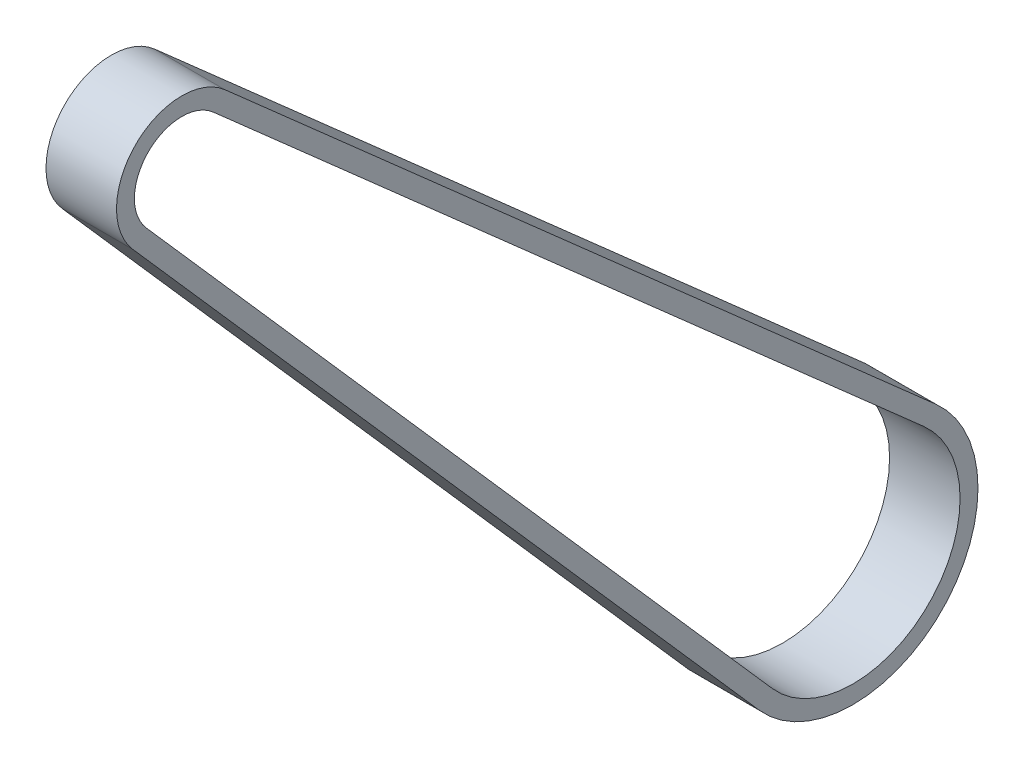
ISO-10303-21;
HEADER;
FILE_DESCRIPTION(('STEP AP214'),'2;1');
FILE_NAME('part.step','',(''),(''),'','','');
FILE_SCHEMA(('AUTOMOTIVE_DESIGN { 1 0 10303 214 1 1 1 1 }'));
ENDSEC;
DATA;
#1=APPLICATION_CONTEXT('core data for automotive mechanical design processes');
#2=APPLICATION_PROTOCOL_DEFINITION('international standard','automotive_design',2000,#1);
#3=PRODUCT_CONTEXT('',#1,'mechanical');
#4=PRODUCT('Part','Part','',(#3));
#5=PRODUCT_RELATED_PRODUCT_CATEGORY('part','',(#4));
#6=PRODUCT_DEFINITION_FORMATION('','',#4);
#7=PRODUCT_DEFINITION_CONTEXT('part definition',#1,'design');
#8=PRODUCT_DEFINITION('design','',#6,#7);
#9=PRODUCT_DEFINITION_SHAPE('','',#8);
#10=(LENGTH_UNIT() NAMED_UNIT(*) SI_UNIT(.MILLI.,.METRE.));
#11=(NAMED_UNIT(*) PLANE_ANGLE_UNIT() SI_UNIT($,.RADIAN.));
#12=(NAMED_UNIT(*) SI_UNIT($,.STERADIAN.) SOLID_ANGLE_UNIT());
#13=UNCERTAINTY_MEASURE_WITH_UNIT(LENGTH_MEASURE(1.E-05),#10,'distance_accuracy_value','');
#14=(GEOMETRIC_REPRESENTATION_CONTEXT(3) GLOBAL_UNCERTAINTY_ASSIGNED_CONTEXT((#13)) GLOBAL_UNIT_ASSIGNED_CONTEXT((#10,
#11,#12)) REPRESENTATION_CONTEXT('',''));
#15=CARTESIAN_POINT('',(0.,0.,0.));
#16=DIRECTION('',(0.,0.,1.));
#17=DIRECTION('',(1.,0.,0.));
#18=AXIS2_PLACEMENT_3D('',#15,#16,#17);
#19=CARTESIAN_POINT('',(238.88,-250.085515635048,228.026107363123));
#20=DIRECTION('',(1.,0.,0.));
#21=DIRECTION('',(0.,1.,0.));
#22=AXIS2_PLACEMENT_3D('',#19,#20,#21);
#23=PLANE('',#22);
#24=DIRECTION('',(0.,-0.750938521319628,-0.66037212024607));
#25=VECTOR('',#24,1.);
#26=CARTESIAN_POINT('',(238.88,-189.420102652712,311.75671447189));
#27=LINE('',#26,#25);
#28=CARTESIAN_POINT('',(238.88,-113.688437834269,378.354816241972));
#29=VERTEX_POINT('',#28);
#30=CARTESIAN_POINT('',(238.88,-265.151767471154,245.158612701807));
#31=VERTEX_POINT('',#30);
#32=EDGE_CURVE('E135',#29,#31,#27,.T.);
#33=ORIENTED_EDGE('',*,*,#32,.T.);
#34=CARTESIAN_POINT('',(238.88,-250.085515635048,228.026107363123));
#35=DIRECTION('',(1.,0.,0.));
#36=DIRECTION('',(0.,-0.66037212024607,0.750938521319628));
#37=AXIS2_PLACEMENT_3D('',#34,#35,#36);
#38=CIRCLE('',#37,22.8147908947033);
#39=CARTESIAN_POINT('',(238.88,-232.98443962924,212.924190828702));
#40=VERTEX_POINT('',#39);
#41=EDGE_CURVE('E26',#31,#40,#38,.T.);
#42=ORIENTED_EDGE('',*,*,#41,.T.);
#43=DIRECTION('',(0.,0.661935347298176,0.749560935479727));
#44=VECTOR('',#43,1.);
#45=CARTESIAN_POINT('',(238.88,-166.228687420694,288.51692700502));
#46=LINE('',#45,#44);
#47=CARTESIAN_POINT('',(238.88,-99.4729352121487,364.109663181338));
#48=VERTEX_POINT('',#47);
#49=EDGE_CURVE('E131',#40,#48,#46,.T.);
#50=ORIENTED_EDGE('',*,*,#49,.T.);
#51=CARTESIAN_POINT('',(238.88,-107.030304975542,370.783557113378));
#52=DIRECTION('',(1.,0.,0.));
#53=DIRECTION('',(0.,0.749560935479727,-0.661935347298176));
#54=AXIS2_PLACEMENT_3D('',#51,#52,#53);
#55=CIRCLE('',#54,10.0823954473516);
#56=EDGE_CURVE('E226',#48,#29,#55,.T.);
#57=ORIENTED_EDGE('',*,*,#56,.T.);
#58=EDGE_LOOP('',(#33,#42,#50,#57));
#59=FACE_BOUND('',#58,.T.);
#60=DIRECTION('',(0.,-0.750938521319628,-0.66037212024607));
#61=VECTOR('',#60,1.);
#62=CARTESIAN_POINT('',(238.88,-191.936120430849,314.617790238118));
#63=LINE('',#62,#61);
#64=CARTESIAN_POINT('',(238.88,-116.204455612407,381.2158920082));
#65=VERTEX_POINT('',#64);
#66=CARTESIAN_POINT('',(238.88,-267.667785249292,248.019688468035));
#67=VERTEX_POINT('',#66);
#68=EDGE_CURVE('E163',#65,#67,#63,.T.);
#69=ORIENTED_EDGE('',*,*,#68,.F.);
#70=CARTESIAN_POINT('',(238.88,-107.030304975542,370.783557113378));
#71=DIRECTION('',(1.,0.,0.));
#72=DIRECTION('',(0.,0.749560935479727,-0.661935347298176));
#73=AXIS2_PLACEMENT_3D('',#70,#71,#72);
#74=CIRCLE('',#73,13.8923954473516);
#75=CARTESIAN_POINT('',(238.88,-96.617108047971,361.587689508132));
#76=VERTEX_POINT('',#75);
#77=EDGE_CURVE('E89',#76,#65,#74,.T.);
#78=ORIENTED_EDGE('',*,*,#77,.F.);
#79=DIRECTION('',(0.,0.661935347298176,0.749560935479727));
#80=VECTOR('',#79,1.);
#81=CARTESIAN_POINT('',(238.88,-163.372860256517,285.994953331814));
#82=LINE('',#81,#80);
#83=CARTESIAN_POINT('',(238.88,-230.128612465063,210.402217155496));
#84=VERTEX_POINT('',#83);
#85=EDGE_CURVE('E73',#84,#76,#82,.T.);
#86=ORIENTED_EDGE('',*,*,#85,.F.);
#87=CARTESIAN_POINT('',(238.88,-250.085515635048,228.026107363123));
#88=DIRECTION('',(1.,0.,0.));
#89=DIRECTION('',(0.,-0.66037212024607,0.750938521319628));
#90=AXIS2_PLACEMENT_3D('',#87,#88,#89);
#91=CIRCLE('',#90,26.6247908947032);
#92=EDGE_CURVE('E102',#67,#84,#91,.T.);
#93=ORIENTED_EDGE('',*,*,#92,.F.);
#94=EDGE_LOOP('',(#69,#78,#86,#93));
#95=FACE_BOUND('',#94,.T.);
#96=ADVANCED_FACE('F17',(#59,#95),#23,.F.);
#97=CARTESIAN_POINT('',(253.88,-250.085515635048,228.026107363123));
#98=DIRECTION('',(1.,0.,0.));
#99=DIRECTION('',(0.,1.,0.));
#100=AXIS2_PLACEMENT_3D('',#97,#98,#99);
#101=PLANE('',#100);
#102=DIRECTION('',(0.,-0.750938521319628,-0.66037212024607));
#103=VECTOR('',#102,1.);
#104=CARTESIAN_POINT('',(253.88,-189.420102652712,311.75671447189));
#105=LINE('',#104,#103);
#106=CARTESIAN_POINT('',(253.88,-113.688437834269,378.354816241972));
#107=VERTEX_POINT('',#106);
#108=CARTESIAN_POINT('',(253.88,-265.151767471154,245.158612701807));
#109=VERTEX_POINT('',#108);
#110=EDGE_CURVE('E204',#107,#109,#105,.T.);
#111=ORIENTED_EDGE('',*,*,#110,.F.);
#112=CARTESIAN_POINT('',(253.88,-107.030304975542,370.783557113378));
#113=DIRECTION('',(1.,0.,0.));
#114=DIRECTION('',(0.,0.749560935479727,-0.661935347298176));
#115=AXIS2_PLACEMENT_3D('',#112,#113,#114);
#116=CIRCLE('',#115,10.0823954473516);
#117=CARTESIAN_POINT('',(253.88,-99.4729352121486,364.109663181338));
#118=VERTEX_POINT('',#117);
#119=EDGE_CURVE('E154',#118,#107,#116,.T.);
#120=ORIENTED_EDGE('',*,*,#119,.F.);
#121=DIRECTION('',(0.,0.661935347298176,0.749560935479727));
#122=VECTOR('',#121,1.);
#123=CARTESIAN_POINT('',(253.88,-166.228687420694,288.51692700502));
#124=LINE('',#123,#122);
#125=CARTESIAN_POINT('',(253.88,-232.98443962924,212.924190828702));
#126=VERTEX_POINT('',#125);
#127=EDGE_CURVE('E147',#126,#118,#124,.T.);
#128=ORIENTED_EDGE('',*,*,#127,.F.);
#129=CARTESIAN_POINT('',(253.88,-250.085515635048,228.026107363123));
#130=DIRECTION('',(1.,0.,0.));
#131=DIRECTION('',(0.,-0.66037212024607,0.750938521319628));
#132=AXIS2_PLACEMENT_3D('',#129,#130,#131);
#133=CIRCLE('',#132,22.8147908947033);
#134=EDGE_CURVE('E11',#109,#126,#133,.T.);
#135=ORIENTED_EDGE('',*,*,#134,.F.);
#136=EDGE_LOOP('',(#111,#120,#128,#135));
#137=FACE_BOUND('',#136,.T.);
#138=DIRECTION('',(0.,-0.750938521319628,-0.66037212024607));
#139=VECTOR('',#138,1.);
#140=CARTESIAN_POINT('',(253.88,-191.936120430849,314.617790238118));
#141=LINE('',#140,#139);
#142=CARTESIAN_POINT('',(253.88,-116.204455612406,381.2158920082));
#143=VERTEX_POINT('',#142);
#144=CARTESIAN_POINT('',(253.88,-267.667785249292,248.019688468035));
#145=VERTEX_POINT('',#144);
#146=EDGE_CURVE('E95',#143,#145,#141,.T.);
#147=ORIENTED_EDGE('',*,*,#146,.T.);
#148=CARTESIAN_POINT('',(253.88,-250.085515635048,228.026107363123));
#149=DIRECTION('',(1.,0.,0.));
#150=DIRECTION('',(0.,-0.66037212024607,0.750938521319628));
#151=AXIS2_PLACEMENT_3D('',#148,#149,#150);
#152=CIRCLE('',#151,26.6247908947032);
#153=CARTESIAN_POINT('',(253.88,-230.128612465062,210.402217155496));
#154=VERTEX_POINT('',#153);
#155=EDGE_CURVE('E92',#145,#154,#152,.T.);
#156=ORIENTED_EDGE('',*,*,#155,.T.);
#157=DIRECTION('',(0.,0.661935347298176,0.749560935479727));
#158=VECTOR('',#157,1.);
#159=CARTESIAN_POINT('',(253.88,-163.372860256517,285.994953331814));
#160=LINE('',#159,#158);
#161=CARTESIAN_POINT('',(253.88,-96.6171080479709,361.587689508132));
#162=VERTEX_POINT('',#161);
#163=EDGE_CURVE('E80',#154,#162,#160,.T.);
#164=ORIENTED_EDGE('',*,*,#163,.T.);
#165=CARTESIAN_POINT('',(253.88,-107.030304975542,370.783557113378));
#166=DIRECTION('',(1.,0.,0.));
#167=DIRECTION('',(0.,0.749560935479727,-0.661935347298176));
#168=AXIS2_PLACEMENT_3D('',#165,#166,#167);
#169=CIRCLE('',#168,13.8923954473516);
#170=EDGE_CURVE('E39',#162,#143,#169,.T.);
#171=ORIENTED_EDGE('',*,*,#170,.T.);
#172=EDGE_LOOP('',(#147,#156,#164,#171));
#173=FACE_BOUND('',#172,.T.);
#174=ADVANCED_FACE('F93',(#137,#173),#101,.T.);
#175=CARTESIAN_POINT('',(253.88,-250.085515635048,228.026107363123));
#176=DIRECTION('',(-1.,0.,0.));
#177=DIRECTION('',(0.,-1.,0.));
#178=AXIS2_PLACEMENT_3D('',#175,#176,#177);
#179=CYLINDRICAL_SURFACE('',#178,22.8147908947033);
#180=ORIENTED_EDGE('',*,*,#41,.F.);
#181=DIRECTION('',(-1.,0.,0.));
#182=VECTOR('',#181,1.);
#183=CARTESIAN_POINT('',(253.88,-265.151767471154,245.158612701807));
#184=LINE('',#183,#182);
#185=EDGE_CURVE('E210',#109,#31,#184,.T.);
#186=ORIENTED_EDGE('',*,*,#185,.F.);
#187=ORIENTED_EDGE('',*,*,#134,.T.);
#188=DIRECTION('',(-1.,0.,0.));
#189=VECTOR('',#188,1.);
#190=CARTESIAN_POINT('',(253.88,-232.98443962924,212.924190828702));
#191=LINE('',#190,#189);
#192=EDGE_CURVE('E140',#126,#40,#191,.T.);
#193=ORIENTED_EDGE('',*,*,#192,.T.);
#194=EDGE_LOOP('',(#180,#186,#187,#193));
#195=FACE_BOUND('',#194,.T.);
#196=ADVANCED_FACE('F141',(#195),#179,.F.);
#197=CARTESIAN_POINT('',(253.88,-107.030304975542,370.783557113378));
#198=DIRECTION('',(-1.,0.,0.));
#199=DIRECTION('',(0.,-1.,0.));
#200=AXIS2_PLACEMENT_3D('',#197,#198,#199);
#201=CYLINDRICAL_SURFACE('',#200,13.8923954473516);
#202=ORIENTED_EDGE('',*,*,#77,.T.);
#203=DIRECTION('',(-1.,0.,0.));
#204=VECTOR('',#203,1.);
#205=CARTESIAN_POINT('',(253.88,-116.204455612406,381.2158920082));
#206=LINE('',#205,#204);
#207=EDGE_CURVE('E108',#143,#65,#206,.T.);
#208=ORIENTED_EDGE('',*,*,#207,.F.);
#209=ORIENTED_EDGE('',*,*,#170,.F.);
#210=DIRECTION('',(-1.,0.,0.));
#211=VECTOR('',#210,1.);
#212=CARTESIAN_POINT('',(253.88,-96.6171080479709,361.587689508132));
#213=LINE('',#212,#211);
#214=EDGE_CURVE('E86',#162,#76,#213,.T.);
#215=ORIENTED_EDGE('',*,*,#214,.T.);
#216=EDGE_LOOP('',(#202,#208,#209,#215));
#217=FACE_BOUND('',#216,.T.);
#218=ADVANCED_FACE('F180',(#217),#201,.T.);
#219=CARTESIAN_POINT('',(253.88,-163.372860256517,285.994953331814));
#220=DIRECTION('',(0.,-0.749560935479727,0.661935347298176));
#221=DIRECTION('',(-1.,0.,0.));
#222=AXIS2_PLACEMENT_3D('',#219,#220,#221);
#223=PLANE('',#222);
#224=ORIENTED_EDGE('',*,*,#85,.T.);
#225=ORIENTED_EDGE('',*,*,#214,.F.);
#226=ORIENTED_EDGE('',*,*,#163,.F.);
#227=DIRECTION('',(-1.,0.,0.));
#228=VECTOR('',#227,1.);
#229=CARTESIAN_POINT('',(253.88,-230.128612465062,210.402217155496));
#230=LINE('',#229,#228);
#231=EDGE_CURVE('E84',#154,#84,#230,.T.);
#232=ORIENTED_EDGE('',*,*,#231,.T.);
#233=EDGE_LOOP('',(#224,#225,#226,#232));
#234=FACE_BOUND('',#233,.T.);
#235=ADVANCED_FACE('F82',(#234),#223,.F.);
#236=CARTESIAN_POINT('',(253.88,-250.085515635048,228.026107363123));
#237=DIRECTION('',(-1.,0.,0.));
#238=DIRECTION('',(0.,-1.,0.));
#239=AXIS2_PLACEMENT_3D('',#236,#237,#238);
#240=CYLINDRICAL_SURFACE('',#239,26.6247908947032);
#241=ORIENTED_EDGE('',*,*,#92,.T.);
#242=ORIENTED_EDGE('',*,*,#231,.F.);
#243=ORIENTED_EDGE('',*,*,#155,.F.);
#244=DIRECTION('',(-1.,0.,0.));
#245=VECTOR('',#244,1.);
#246=CARTESIAN_POINT('',(253.88,-267.667785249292,248.019688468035));
#247=LINE('',#246,#245);
#248=EDGE_CURVE('E167',#145,#67,#247,.T.);
#249=ORIENTED_EDGE('',*,*,#248,.T.);
#250=EDGE_LOOP('',(#241,#242,#243,#249));
#251=FACE_BOUND('',#250,.T.);
#252=ADVANCED_FACE('F101',(#251),#240,.T.);
#253=CARTESIAN_POINT('',(253.88,-191.936120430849,314.617790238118));
#254=DIRECTION('',(0.,0.66037212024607,-0.750938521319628));
#255=DIRECTION('',(-1.,0.,0.));
#256=AXIS2_PLACEMENT_3D('',#253,#254,#255);
#257=PLANE('',#256);
#258=ORIENTED_EDGE('',*,*,#68,.T.);
#259=ORIENTED_EDGE('',*,*,#248,.F.);
#260=ORIENTED_EDGE('',*,*,#146,.F.);
#261=ORIENTED_EDGE('',*,*,#207,.T.);
#262=EDGE_LOOP('',(#258,#259,#260,#261));
#263=FACE_BOUND('',#262,.T.);
#264=ADVANCED_FACE('F177',(#263),#257,.F.);
#265=CARTESIAN_POINT('',(253.88,-166.228687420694,288.51692700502));
#266=DIRECTION('',(0.,-0.749560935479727,0.661935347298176));
#267=DIRECTION('',(-1.,0.,0.));
#268=AXIS2_PLACEMENT_3D('',#265,#266,#267);
#269=PLANE('',#268);
#270=ORIENTED_EDGE('',*,*,#49,.F.);
#271=ORIENTED_EDGE('',*,*,#192,.F.);
#272=ORIENTED_EDGE('',*,*,#127,.T.);
#273=DIRECTION('',(-1.,0.,0.));
#274=VECTOR('',#273,1.);
#275=CARTESIAN_POINT('',(253.88,-99.4729352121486,364.109663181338));
#276=LINE('',#275,#274);
#277=EDGE_CURVE('E151',#118,#48,#276,.T.);
#278=ORIENTED_EDGE('',*,*,#277,.T.);
#279=EDGE_LOOP('',(#270,#271,#272,#278));
#280=FACE_BOUND('',#279,.T.);
#281=ADVANCED_FACE('F149',(#280),#269,.T.);
#282=CARTESIAN_POINT('',(253.88,-107.030304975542,370.783557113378));
#283=DIRECTION('',(-1.,0.,0.));
#284=DIRECTION('',(0.,-1.,0.));
#285=AXIS2_PLACEMENT_3D('',#282,#283,#284);
#286=CYLINDRICAL_SURFACE('',#285,10.0823954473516);
#287=ORIENTED_EDGE('',*,*,#56,.F.);
#288=ORIENTED_EDGE('',*,*,#277,.F.);
#289=ORIENTED_EDGE('',*,*,#119,.T.);
#290=DIRECTION('',(-1.,0.,0.));
#291=VECTOR('',#290,1.);
#292=CARTESIAN_POINT('',(253.88,-113.688437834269,378.354816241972));
#293=LINE('',#292,#291);
#294=EDGE_CURVE('E211',#107,#29,#293,.T.);
#295=ORIENTED_EDGE('',*,*,#294,.T.);
#296=EDGE_LOOP('',(#287,#288,#289,#295));
#297=FACE_BOUND('',#296,.T.);
#298=ADVANCED_FACE('F233',(#297),#286,.F.);
#299=CARTESIAN_POINT('',(253.88,-189.420102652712,311.75671447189));
#300=DIRECTION('',(0.,0.66037212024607,-0.750938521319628));
#301=DIRECTION('',(-1.,0.,0.));
#302=AXIS2_PLACEMENT_3D('',#299,#300,#301);
#303=PLANE('',#302);
#304=ORIENTED_EDGE('',*,*,#32,.F.);
#305=ORIENTED_EDGE('',*,*,#294,.F.);
#306=ORIENTED_EDGE('',*,*,#110,.T.);
#307=ORIENTED_EDGE('',*,*,#185,.T.);
#308=EDGE_LOOP('',(#304,#305,#306,#307));
#309=FACE_BOUND('',#308,.T.);
#310=ADVANCED_FACE('F214',(#309),#303,.T.);
#311=CLOSED_SHELL('',(#96,#174,#196,#218,#235,#252,#264,#281,#298,#310));
#312=MANIFOLD_SOLID_BREP('B1',#311);
#313=ADVANCED_BREP_SHAPE_REPRESENTATION('',(#18,#312),#14);
#314=SHAPE_DEFINITION_REPRESENTATION(#9,#313);
ENDSEC;
END-ISO-10303-21;
